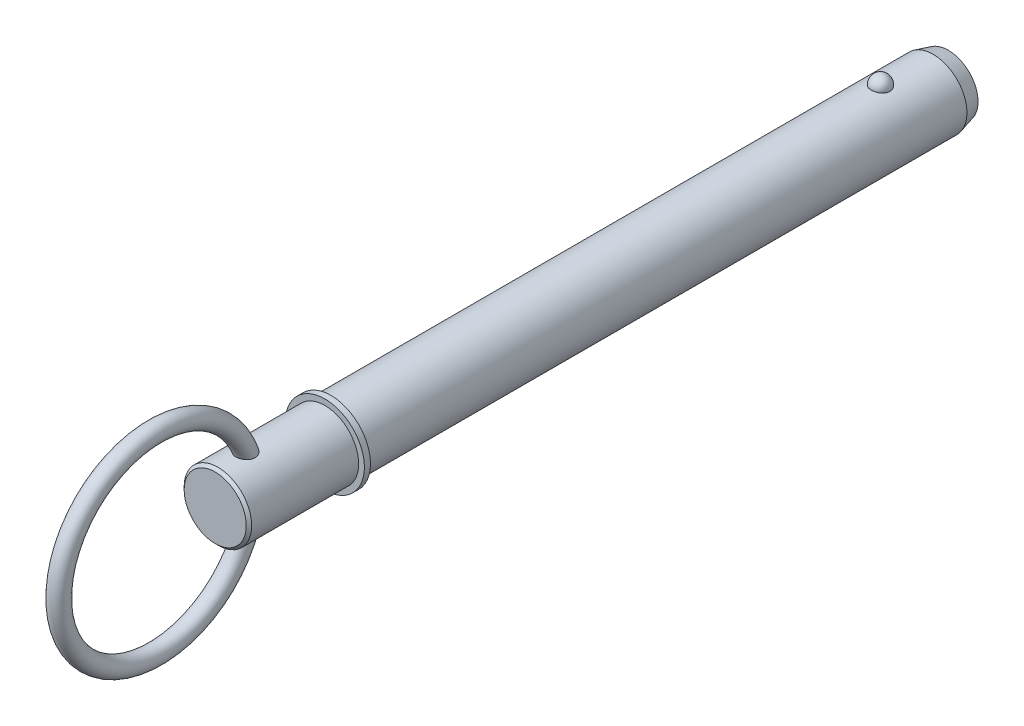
ISO-10303-21;
HEADER;
FILE_DESCRIPTION(('STEP AP214'),'2;1');
FILE_NAME('part.step','',(''),(''),'','','');
FILE_SCHEMA(('AUTOMOTIVE_DESIGN { 1 0 10303 214 1 1 1 1 }'));
ENDSEC;
DATA;
#1=APPLICATION_CONTEXT('core data for automotive mechanical design processes');
#2=APPLICATION_PROTOCOL_DEFINITION('international standard','automotive_design',2000,#1);
#3=PRODUCT_CONTEXT('',#1,'mechanical');
#4=PRODUCT('Part','Part','',(#3));
#5=PRODUCT_RELATED_PRODUCT_CATEGORY('part','',(#4));
#6=PRODUCT_DEFINITION_FORMATION('','',#4);
#7=PRODUCT_DEFINITION_CONTEXT('part definition',#1,'design');
#8=PRODUCT_DEFINITION('design','',#6,#7);
#9=PRODUCT_DEFINITION_SHAPE('','',#8);
#10=(LENGTH_UNIT() NAMED_UNIT(*) SI_UNIT(.MILLI.,.METRE.));
#11=(NAMED_UNIT(*) PLANE_ANGLE_UNIT() SI_UNIT($,.RADIAN.));
#12=(NAMED_UNIT(*) SI_UNIT($,.STERADIAN.) SOLID_ANGLE_UNIT());
#13=UNCERTAINTY_MEASURE_WITH_UNIT(LENGTH_MEASURE(1.E-05),#10,'distance_accuracy_value','');
#14=(GEOMETRIC_REPRESENTATION_CONTEXT(3) GLOBAL_UNCERTAINTY_ASSIGNED_CONTEXT((#13)) GLOBAL_UNIT_ASSIGNED_CONTEXT((#10,
#11,#12)) REPRESENTATION_CONTEXT('',''));
#15=CARTESIAN_POINT('',(0.,0.,0.));
#16=DIRECTION('',(0.,0.,1.));
#17=DIRECTION('',(1.,0.,0.));
#18=AXIS2_PLACEMENT_3D('',#15,#16,#17);
#19=CARTESIAN_POINT('',(0.,0.,177.8));
#20=DIRECTION('',(0.,0.,-1.));
#21=DIRECTION('',(-1.,0.,0.));
#22=AXIS2_PLACEMENT_3D('',#19,#20,#21);
#23=CYLINDRICAL_SURFACE('',#22,11.115);
#24=CARTESIAN_POINT('',(3.04058343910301,10.6910278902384,-3.06999999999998));
#25=CARTESIAN_POINT('',(3.04058039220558,10.6910304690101,-2.89837124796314));
#26=CARTESIAN_POINT('',(3.02657193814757,10.6950430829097,-2.72670368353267));
#27=CARTESIAN_POINT('',(2.97087341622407,10.7106465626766,-2.38822964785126));
#28=CARTESIAN_POINT('',(2.92917240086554,10.7222404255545,-2.22142512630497));
#29=CARTESIAN_POINT('',(2.81915317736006,10.751689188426,-1.89750816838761));
#30=CARTESIAN_POINT('',(2.75084669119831,10.7695413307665,-1.74039149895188));
#31=CARTESIAN_POINT('',(2.58932284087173,10.809510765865,-1.4401395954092));
#32=CARTESIAN_POINT('',(2.49610617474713,10.8316279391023,-1.29700396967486));
#33=CARTESIAN_POINT('',(2.28659317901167,10.877786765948,-1.02797591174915));
#34=CARTESIAN_POINT('',(2.17018825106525,10.9018371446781,-0.902169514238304));
#35=CARTESIAN_POINT('',(1.91759004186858,10.9490888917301,-0.672091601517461));
#36=CARTESIAN_POINT('',(1.78139672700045,10.9722902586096,-0.567820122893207));
#37=CARTESIAN_POINT('',(1.49327884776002,11.0151925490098,-0.38399276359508));
#38=CARTESIAN_POINT('',(1.34139928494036,11.034903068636,-0.304368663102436));
#39=CARTESIAN_POINT('',(1.02584823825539,11.0686948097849,-0.171731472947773));
#40=CARTESIAN_POINT('',(0.86217801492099,11.0827766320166,-0.118715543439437));
#41=CARTESIAN_POINT('',(0.530748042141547,11.1035404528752,-0.041530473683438));
#42=CARTESIAN_POINT('',(0.363109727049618,11.1103474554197,-0.0168734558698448));
#43=CARTESIAN_POINT('',(0.0259327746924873,11.1162480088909,0.00453486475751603));
#44=CARTESIAN_POINT('',(-0.143605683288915,11.1153422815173,0.00128877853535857));
#45=CARTESIAN_POINT('',(-0.477280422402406,11.1059854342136,-0.0327676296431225));
#46=CARTESIAN_POINT('',(-0.641459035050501,11.0976393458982,-0.0631942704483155));
#47=CARTESIAN_POINT('',(-0.962236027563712,11.0744390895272,-0.150220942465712));
#48=CARTESIAN_POINT('',(-1.11883427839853,11.0595848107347,-0.206821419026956));
#49=CARTESIAN_POINT('',(-1.4210461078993,11.0248420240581,-0.345028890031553));
#50=CARTESIAN_POINT('',(-1.56659244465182,11.0049254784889,-0.426775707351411));
#51=CARTESIAN_POINT('',(-1.84189316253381,10.9622119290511,-0.612956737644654));
#52=CARTESIAN_POINT('',(-1.97164597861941,10.9394146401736,-0.717393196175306));
#53=CARTESIAN_POINT('',(-2.21432263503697,10.8929139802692,-0.948332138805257));
#54=CARTESIAN_POINT('',(-2.3268890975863,10.8692016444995,-1.07520847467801));
#55=CARTESIAN_POINT('',(-2.52940007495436,10.8238699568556,-1.34622145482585));
#56=CARTESIAN_POINT('',(-2.6193430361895,10.8022507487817,-1.49035928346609));
#57=CARTESIAN_POINT('',(-2.77523958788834,10.7632629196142,-1.79367507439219));
#58=CARTESIAN_POINT('',(-2.8409151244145,10.7459442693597,-1.95300253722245));
#59=CARTESIAN_POINT('',(-2.94519180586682,10.7178360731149,-2.28083009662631));
#60=CARTESIAN_POINT('',(-2.98379371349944,10.707046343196,-2.44932993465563));
#61=CARTESIAN_POINT('',(-3.03284665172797,10.6932559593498,-2.78998091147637));
#62=CARTESIAN_POINT('',(-3.04341313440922,10.6902233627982,-2.96211412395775));
#63=CARTESIAN_POINT('',(-3.03646037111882,10.6922002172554,-3.30576225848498));
#64=CARTESIAN_POINT('',(-3.0189418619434,10.6972094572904,-3.47727719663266));
#65=CARTESIAN_POINT('',(-2.95641582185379,10.7146564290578,-3.81396465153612));
#66=CARTESIAN_POINT('',(-2.91154117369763,10.7270582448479,-3.97916375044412));
#67=CARTESIAN_POINT('',(-2.79553341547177,10.7578713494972,-4.29947360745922));
#68=CARTESIAN_POINT('',(-2.72439927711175,10.7762828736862,-4.45458397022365));
#69=CARTESIAN_POINT('',(-2.55718900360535,10.8171819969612,-4.75123550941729));
#70=CARTESIAN_POINT('',(-2.46098224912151,10.8396907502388,-4.89270014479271));
#71=CARTESIAN_POINT('',(-2.24623042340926,10.8862165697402,-5.15724095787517));
#72=CARTESIAN_POINT('',(-2.12768452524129,10.9102336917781,-5.28031645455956));
#73=CARTESIAN_POINT('',(-1.87085107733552,10.9571990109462,-5.50509615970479));
#74=CARTESIAN_POINT('',(-1.73249451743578,10.9801430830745,-5.6067224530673));
#75=CARTESIAN_POINT('',(-1.44010079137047,11.0223008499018,-5.78517789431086));
#76=CARTESIAN_POINT('',(-1.28606470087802,11.0415148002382,-5.86200874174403));
#77=CARTESIAN_POINT('',(-0.968615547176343,11.0738491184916,-5.98788441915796));
#78=CARTESIAN_POINT('',(-0.805339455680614,11.0870408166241,-6.0372561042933));
#79=CARTESIAN_POINT('',(-0.47244987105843,11.1062048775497,-6.10820004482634));
#80=CARTESIAN_POINT('',(-0.302837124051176,11.11217808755,-6.12977556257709));
#81=CARTESIAN_POINT('',(0.0345765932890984,11.1162034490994,-6.14436196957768));
#82=CARTESIAN_POINT('',(0.20235372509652,11.1143988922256,-6.13788957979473));
#83=CARTESIAN_POINT('',(0.534364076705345,11.103390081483,-6.0977398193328));
#84=CARTESIAN_POINT('',(0.698597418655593,11.094186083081,-6.06406338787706));
#85=CARTESIAN_POINT('',(1.01830314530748,11.0694136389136,-5.97063285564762));
#86=CARTESIAN_POINT('',(1.17380497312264,11.0538682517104,-5.91097318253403));
#87=CARTESIAN_POINT('',(1.472484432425,11.0180608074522,-5.76723645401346));
#88=CARTESIAN_POINT('',(1.6156613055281,10.9977984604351,-5.68315789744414));
#89=CARTESIAN_POINT('',(1.88801614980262,10.9543574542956,-5.49138807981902));
#90=CARTESIAN_POINT('',(2.01695079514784,10.9311394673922,-5.38336024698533));
#91=CARTESIAN_POINT('',(2.25501495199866,10.8845248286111,-5.14733839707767));
#92=CARTESIAN_POINT('',(2.36414099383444,10.8611281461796,-5.01934088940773));
#93=CARTESIAN_POINT('',(2.56152595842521,10.8162958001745,-4.7444793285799));
#94=CARTESIAN_POINT('',(2.64940088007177,10.7948999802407,-4.59733288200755));
#95=CARTESIAN_POINT('',(2.79961494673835,10.7569242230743,-4.29001203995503));
#96=CARTESIAN_POINT('',(2.86196390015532,10.7403424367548,-4.12984267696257));
#97=CARTESIAN_POINT('',(2.95377333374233,10.715429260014,-3.82062342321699));
#98=CARTESIAN_POINT('',(2.98627018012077,10.7063495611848,-3.67252681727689));
#99=CARTESIAN_POINT('',(3.02967634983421,10.6941478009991,-3.37296350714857));
#100=CARTESIAN_POINT('',(3.04058612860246,10.6910256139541,-3.22149687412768));
#101=CARTESIAN_POINT('',(3.04058343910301,10.6910278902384,-3.06999999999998));
#102=B_SPLINE_CURVE_WITH_KNOTS('',3,(#24,#25,#26,#27,#28,#29,#30,#31,#32,#33,#34,#35,#36,#37,
#38,#39,#40,#41,#42,#43,#44,#45,#46,#47,#48,#49,#50,#51,#52,#53,#54,#55,#56,#57,#58,#59,#60,#61,
#62,#63,#64,#65,#66,#67,#68,#69,#70,#71,#72,#73,#74,#75,#76,#77,#78,#79,#80,#81,#82,#83,#84,#85,
#86,#87,#88,#89,#90,#91,#92,#93,#94,#95,#96,#97,#98,#99,#100,#101),.UNSPECIFIED.,.T.,.F.,(4,2,2,
2,2,2,2,2,2,2,2,2,2,2,2,2,2,2,2,2,2,2,2,2,2,2,2,2,2,2,2,2,2,2,2,2,2,2,4),(0.,0.514341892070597,
1.02888723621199,1.54320613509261,2.0575106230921,2.57428293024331,3.09105611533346,
3.60638589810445,4.1216606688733,4.62793159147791,5.1341551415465,5.63334381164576,
6.13254097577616,6.63456562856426,7.13663998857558,7.64804063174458,8.15947638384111,
8.6766026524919,9.19371435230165,9.70869321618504,10.223658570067,10.7361421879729,
11.2486458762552,11.7638748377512,12.2791228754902,12.7962115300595,13.3132647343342,
13.8240238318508,14.3347229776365,14.8360540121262,15.3373677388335,15.8368746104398,
16.3364121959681,16.8434736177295,17.3506237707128,17.8663484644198,18.3818748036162,
18.8358944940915,19.2899046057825),.UNSPECIFIED.);
#103=CARTESIAN_POINT('',(3.04058343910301,10.6910278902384,-3.06999999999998));
#104=VERTEX_POINT('',#103);
#105=EDGE_CURVE('E102',#104,#104,#102,.T.);
#106=ORIENTED_EDGE('',*,*,#105,.T.);
#107=EDGE_LOOP('',(#106));
#108=FACE_BOUND('',#107,.T.);
#109=CARTESIAN_POINT('',(0.,0.,-20.3999999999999));
#110=DIRECTION('',(0.,0.,-1.));
#111=DIRECTION('',(-1.,0.,0.));
#112=AXIS2_PLACEMENT_3D('',#109,#110,#111);
#113=CIRCLE('',#112,11.115);
#114=CARTESIAN_POINT('',(-11.115,0.,-20.3999999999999));
#115=VERTEX_POINT('',#114);
#116=EDGE_CURVE('E110',#115,#115,#113,.F.);
#117=ORIENTED_EDGE('',*,*,#116,.T.);
#118=EDGE_LOOP('',(#117));
#119=FACE_BOUND('',#118,.T.);
#120=CARTESIAN_POINT('',(0.,0.,177.8));
#121=DIRECTION('',(0.,0.,1.));
#122=DIRECTION('',(1.,0.,0.));
#123=AXIS2_PLACEMENT_3D('',#120,#121,#122);
#124=CIRCLE('',#123,11.115);
#125=CARTESIAN_POINT('',(11.115,0.,177.8));
#126=VERTEX_POINT('',#125);
#127=EDGE_CURVE('E108',#126,#126,#124,.T.);
#128=ORIENTED_EDGE('',*,*,#127,.F.);
#129=EDGE_LOOP('',(#128));
#130=FACE_BOUND('',#129,.T.);
#131=ADVANCED_FACE('F39',(#108,#119,#130),#23,.T.);
#132=CARTESIAN_POINT('',(0.,0.,-25.4));
#133=DIRECTION('',(0.,0.,-1.));
#134=DIRECTION('',(-1.,0.,0.));
#135=AXIS2_PLACEMENT_3D('',#132,#133,#134);
#136=PLANE('',#135);
#137=CARTESIAN_POINT('',(0.,0.,-25.4));
#138=DIRECTION('',(0.,0.,-1.));
#139=DIRECTION('',(-1.,0.,0.));
#140=AXIS2_PLACEMENT_3D('',#137,#138,#139);
#141=CIRCLE('',#140,9.77525403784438);
#142=CARTESIAN_POINT('',(-9.77525403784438,0.,-25.4));
#143=VERTEX_POINT('',#142);
#144=EDGE_CURVE('E142',#143,#143,#141,.T.);
#145=ORIENTED_EDGE('',*,*,#144,.T.);
#146=EDGE_LOOP('',(#145));
#147=FACE_BOUND('',#146,.T.);
#148=ADVANCED_FACE('F88',(#147),#136,.T.);
#149=CARTESIAN_POINT('',(0.,0.,-25.4));
#150=DIRECTION('',(0.,0.,1.));
#151=DIRECTION('',(1.,0.,0.));
#152=AXIS2_PLACEMENT_3D('',#149,#150,#151);
#153=CONICAL_SURFACE('',#152,9.77525403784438,0.261799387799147);
#154=ORIENTED_EDGE('',*,*,#116,.F.);
#155=EDGE_LOOP('',(#154));
#156=FACE_BOUND('',#155,.T.);
#157=ORIENTED_EDGE('',*,*,#144,.F.);
#158=EDGE_LOOP('',(#157));
#159=FACE_BOUND('',#158,.T.);
#160=ADVANCED_FACE('F94',(#156,#159),#153,.T.);
#161=CARTESIAN_POINT('',(0.,11.115,-3.06999999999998));
#162=DIRECTION('',(0.,1.,0.));
#163=DIRECTION('',(0.,0.,1.));
#164=AXIS2_PLACEMENT_3D('',#161,#162,#163);
#165=SPHERICAL_SURFACE('',#164,3.07);
#166=ORIENTED_EDGE('',*,*,#105,.F.);
#167=EDGE_LOOP('',(#166));
#168=FACE_BOUND('',#167,.T.);
#169=ADVANCED_FACE('F113',(#168),#165,.T.);
#170=CARTESIAN_POINT('',(0.,0.,177.8));
#171=DIRECTION('',(0.,0.,-1.));
#172=DIRECTION('',(-1.,0.,0.));
#173=AXIS2_PLACEMENT_3D('',#170,#171,#172);
#174=PLANE('',#173);
#175=ORIENTED_EDGE('',*,*,#127,.T.);
#176=EDGE_LOOP('',(#175));
#177=FACE_BOUND('',#176,.T.);
#178=CARTESIAN_POINT('',(0.,0.,177.8));
#179=DIRECTION('',(0.,0.,-1.));
#180=DIRECTION('',(-1.,0.,0.));
#181=AXIS2_PLACEMENT_3D('',#178,#179,#180);
#182=CIRCLE('',#181,13.);
#183=CARTESIAN_POINT('',(-13.,0.,177.8));
#184=VERTEX_POINT('',#183);
#185=EDGE_CURVE('E109',#184,#184,#182,.T.);
#186=ORIENTED_EDGE('',*,*,#185,.T.);
#187=EDGE_LOOP('',(#186));
#188=FACE_BOUND('',#187,.T.);
#189=ADVANCED_FACE('F117',(#177,#188),#174,.T.);
#190=CARTESIAN_POINT('',(0.,0.,33.7287874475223));
#191=DIRECTION('',(0.,0.,-1.));
#192=DIRECTION('',(-1.,0.,0.));
#193=AXIS2_PLACEMENT_3D('',#190,#191,#192);
#194=CYLINDRICAL_SURFACE('',#193,13.);
#195=CARTESIAN_POINT('',(0.,0.,179.8));
#196=DIRECTION('',(0.,0.,-1.));
#197=DIRECTION('',(-1.,0.,0.));
#198=AXIS2_PLACEMENT_3D('',#195,#196,#197);
#199=CIRCLE('',#198,13.);
#200=CARTESIAN_POINT('',(-13.,0.,179.8));
#201=VERTEX_POINT('',#200);
#202=EDGE_CURVE('E134',#201,#201,#199,.T.);
#203=ORIENTED_EDGE('',*,*,#202,.T.);
#204=EDGE_LOOP('',(#203));
#205=FACE_BOUND('',#204,.T.);
#206=ORIENTED_EDGE('',*,*,#185,.F.);
#207=EDGE_LOOP('',(#206));
#208=FACE_BOUND('',#207,.T.);
#209=ADVANCED_FACE('F121',(#205,#208),#194,.T.);
#210=CARTESIAN_POINT('',(0.,13.,179.8));
#211=DIRECTION('',(0.,0.,1.));
#212=DIRECTION('',(1.,0.,0.));
#213=AXIS2_PLACEMENT_3D('',#210,#211,#212);
#214=PLANE('',#213);
#215=CARTESIAN_POINT('',(0.,0.,179.8));
#216=DIRECTION('',(0.,0.,1.));
#217=DIRECTION('',(1.,0.,0.));
#218=AXIS2_PLACEMENT_3D('',#215,#216,#217);
#219=CIRCLE('',#218,11.115);
#220=CARTESIAN_POINT('',(11.115,0.,179.8));
#221=VERTEX_POINT('',#220);
#222=EDGE_CURVE('E112',#221,#221,#219,.T.);
#223=ORIENTED_EDGE('',*,*,#222,.F.);
#224=EDGE_LOOP('',(#223));
#225=FACE_BOUND('',#224,.T.);
#226=ORIENTED_EDGE('',*,*,#202,.F.);
#227=EDGE_LOOP('',(#226));
#228=FACE_BOUND('',#227,.T.);
#229=ADVANCED_FACE('F85',(#225,#228),#214,.T.);
#230=CARTESIAN_POINT('',(0.,0.,215.9));
#231=DIRECTION('',(0.,0.,-1.));
#232=DIRECTION('',(-1.,0.,0.));
#233=AXIS2_PLACEMENT_3D('',#230,#231,#232);
#234=CYLINDRICAL_SURFACE('',#233,11.115);
#235=CARTESIAN_POINT('',(-1.22435852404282,-11.0473603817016,202.978419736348));
#236=CARTESIAN_POINT('',(-1.0707801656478,-11.0643805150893,202.911699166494));
#237=CARTESIAN_POINT('',(-0.911372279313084,-11.0787777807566,202.857745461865));
#238=CARTESIAN_POINT('',(-0.585451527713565,-11.1007717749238,202.776552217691));
#239=CARTESIAN_POINT('',(-0.418938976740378,-11.1083688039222,202.749311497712));
#240=CARTESIAN_POINT('',(-0.0835394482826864,-11.1159515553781,202.722121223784));
#241=CARTESIAN_POINT('',(0.0853474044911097,-11.1159376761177,202.722170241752));
#242=CARTESIAN_POINT('',(0.420723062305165,-11.1083011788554,202.749554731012));
#243=CARTESIAN_POINT('',(0.58721183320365,-11.1006784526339,202.776890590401));
#244=CARTESIAN_POINT('',(0.913189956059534,-11.0786293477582,202.85829957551));
#245=CARTESIAN_POINT('',(1.07267378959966,-11.0641977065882,202.912393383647));
#246=CARTESIAN_POINT('',(1.3799404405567,-11.0300907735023,203.046140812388));
#247=CARTESIAN_POINT('',(1.52772335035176,-11.0104155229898,203.125794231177));
#248=CARTESIAN_POINT('',(1.80679367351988,-10.9680716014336,203.308467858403));
#249=CARTESIAN_POINT('',(1.93814041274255,-10.945414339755,203.411400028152));
#250=CARTESIAN_POINT('',(2.18117403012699,-10.8995884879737,203.638212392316));
#251=CARTESIAN_POINT('',(2.29286356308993,-10.8764199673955,203.762089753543));
#252=CARTESIAN_POINT('',(2.49238969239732,-10.8324319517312,204.025992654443));
#253=CARTESIAN_POINT('',(2.58046870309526,-10.8115899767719,204.165831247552));
#254=CARTESIAN_POINT('',(2.73218762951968,-10.7742522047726,204.458691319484));
#255=CARTESIAN_POINT('',(2.7958294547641,-10.757756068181,204.611711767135));
#256=CARTESIAN_POINT('',(2.89767977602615,-10.7307723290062,204.9266092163));
#257=CARTESIAN_POINT('',(2.93586554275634,-10.7202900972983,205.088493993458));
#258=CARTESIAN_POINT('',(2.98678800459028,-10.7062139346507,205.416480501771));
#259=CARTESIAN_POINT('',(2.99951894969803,-10.7026215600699,205.582583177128));
#260=CARTESIAN_POINT('',(3.0004780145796,-10.7023530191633,205.923227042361));
#261=CARTESIAN_POINT('',(2.98743421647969,-10.7060358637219,206.097770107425));
#262=CARTESIAN_POINT('',(2.93592917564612,-10.7202719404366,206.442750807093));
#263=CARTESIAN_POINT('',(2.8974582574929,-10.7308277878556,206.613186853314));
#264=CARTESIAN_POINT('',(2.79180512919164,-10.7588257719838,206.963114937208));
#265=CARTESIAN_POINT('',(2.72213928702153,-10.776850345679,207.141811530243));
#266=CARTESIAN_POINT('',(2.55612841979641,-10.8174264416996,207.485974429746));
#267=CARTESIAN_POINT('',(2.4597569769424,-10.8399824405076,207.651427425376));
#268=CARTESIAN_POINT('',(2.23434632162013,-10.8887625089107,207.975672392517));
#269=CARTESIAN_POINT('',(2.10349593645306,-10.9151327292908,208.133192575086));
#270=CARTESIAN_POINT('',(1.81505097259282,-10.96677510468,208.421668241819));
#271=CARTESIAN_POINT('',(1.65749731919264,-10.9920488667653,208.55266371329));
#272=CARTESIAN_POINT('',(1.36197799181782,-11.0319737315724,208.751313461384));
#273=CARTESIAN_POINT('',(1.22927684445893,-11.0476896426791,208.82660092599));
#274=CARTESIAN_POINT('',(0.952979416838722,-11.0749380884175,208.954574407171));
#275=CARTESIAN_POINT('',(0.809393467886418,-11.0864745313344,209.007281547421));
#276=CARTESIAN_POINT('',(0.513954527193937,-11.1041011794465,209.087058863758));
#277=CARTESIAN_POINT('',(0.362058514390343,-11.1101594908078,209.113978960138));
#278=CARTESIAN_POINT('',(0.0557792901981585,-11.1159132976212,209.139559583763));
#279=CARTESIAN_POINT('',(-0.0986030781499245,-11.1156109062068,209.138229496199));
#280=CARTESIAN_POINT('',(-0.389768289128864,-11.1090283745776,209.108935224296));
#281=CARTESIAN_POINT('',(-0.526830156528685,-11.1033186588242,209.083512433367));
#282=CARTESIAN_POINT('',(-0.794878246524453,-11.0873547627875,209.011270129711));
#283=CARTESIAN_POINT('',(-0.925863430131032,-11.0770998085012,208.964446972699));
#284=CARTESIAN_POINT('',(-1.18354406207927,-11.0525934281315,208.849843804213));
#285=CARTESIAN_POINT('',(-1.30991621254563,-11.0382116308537,208.781371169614));
#286=CARTESIAN_POINT('',(-1.55122352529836,-11.0068962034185,208.627131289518));
#287=CARTESIAN_POINT('',(-1.66615377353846,-10.9899614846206,208.541356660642));
#288=CARTESIAN_POINT('',(-1.90024050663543,-10.9520991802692,208.34087205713));
#289=CARTESIAN_POINT('',(-2.01728342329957,-10.9309598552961,208.223737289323));
#290=CARTESIAN_POINT('',(-2.23333659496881,-10.8888735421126,207.973839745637));
#291=CARTESIAN_POINT('',(-2.33233396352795,-10.8679267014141,207.841065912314));
#292=CARTESIAN_POINT('',(-2.52607041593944,-10.8246766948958,207.540000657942));
#293=CARTESIAN_POINT('',(-2.61741570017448,-10.8027194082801,207.369462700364));
#294=CARTESIAN_POINT('',(-2.77251687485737,-10.7639568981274,207.015671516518));
#295=CARTESIAN_POINT('',(-2.83625783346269,-10.7471544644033,206.832411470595));
#296=CARTESIAN_POINT('',(-2.93668505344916,-10.7201706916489,206.446624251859));
#297=CARTESIAN_POINT('',(-2.97161961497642,-10.7104219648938,206.243594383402));
#298=CARTESIAN_POINT('',(-2.99683495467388,-10.7033740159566,205.936874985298));
#299=CARTESIAN_POINT('',(-3.00070536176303,-10.7022882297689,205.834234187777));
#300=CARTESIAN_POINT('',(-2.99908594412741,-10.7027439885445,205.629049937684));
#301=CARTESIAN_POINT('',(-2.99360154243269,-10.7042840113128,205.526506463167));
#302=CARTESIAN_POINT('',(-2.97382504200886,-10.7097936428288,205.330330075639));
#303=CARTESIAN_POINT('',(-2.9602439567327,-10.7135669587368,205.236619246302));
#304=CARTESIAN_POINT('',(-2.92480741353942,-10.723295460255,205.050932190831));
#305=CARTESIAN_POINT('',(-2.90295619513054,-10.7292495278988,204.95895510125));
#306=CARTESIAN_POINT('',(-2.85097003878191,-10.7431800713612,204.777547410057));
#307=CARTESIAN_POINT('',(-2.82083748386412,-10.7511559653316,204.688116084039));
#308=CARTESIAN_POINT('',(-2.75241691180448,-10.7688750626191,204.51264532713));
#309=CARTESIAN_POINT('',(-2.71412954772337,-10.7786181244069,204.42660562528));
#310=CARTESIAN_POINT('',(-2.59550576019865,-10.807996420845,204.191055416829));
#311=CARTESIAN_POINT('',(-2.50612224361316,-10.8292837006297,204.046173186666));
#312=CARTESIAN_POINT('',(-2.30366035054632,-10.8741467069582,203.774571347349));
#313=CARTESIAN_POINT('',(-2.19058370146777,-10.8977222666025,203.647850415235));
#314=CARTESIAN_POINT('',(-1.94442412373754,-10.9443154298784,203.416462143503));
#315=CARTESIAN_POINT('',(-1.81141354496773,-10.967334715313,203.31171820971));
#316=CARTESIAN_POINT('',(-1.52904284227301,-11.0102504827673,203.126435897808));
#317=CARTESIAN_POINT('',(-1.37968206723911,-11.0301468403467,203.045898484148));
#318=CARTESIAN_POINT('',(-1.22435852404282,-11.0473603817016,202.978419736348));
#319=B_SPLINE_CURVE_WITH_KNOTS('',3,(#235,#236,#237,#238,#239,#240,#241,#242,#243,#244,#245,
#246,#247,#248,#249,#250,#251,#252,#253,#254,#255,#256,#257,#258,#259,#260,#261,#262,#263,#264,
#265,#266,#267,#268,#269,#270,#271,#272,#273,#274,#275,#276,#277,#278,#279,#280,#281,#282,#283,
#284,#285,#286,#287,#288,#289,#290,#291,#292,#293,#294,#295,#296,#297,#298,#299,#300,#301,#302,
#303,#304,#305,#306,#307,#308,#309,#310,#311,#312,#313,#314,#315,#316,#317,#318),.UNSPECIFIED.,
.T.,.F.,(4,2,2,2,2,2,2,2,2,2,2,2,2,2,2,2,2,2,2,2,2,2,2,2,2,2,2,2,2,2,2,2,2,2,2,2,2,2,2,2,2,4),
(0.,0.504317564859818,1.00861284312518,1.51288173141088,2.01715779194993,2.52182424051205,
3.02648670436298,3.52927157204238,4.03198848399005,4.52932690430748,5.02662645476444,
5.5243694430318,6.02222485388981,6.54526169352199,7.06849767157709,7.64398785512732,
8.22004937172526,8.83633461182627,9.45168373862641,9.90997173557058,10.3678300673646,
10.8283372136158,11.2886913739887,11.7053264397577,12.1220324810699,12.5537129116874,
12.9855779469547,13.4844842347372,13.9837454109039,14.5653303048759,15.1472294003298,
15.762338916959,16.0701226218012,16.3777279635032,16.6616380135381,16.9454027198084,
17.229085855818,17.5127462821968,18.0246262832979,18.5364689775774,19.0464970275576,
19.5565453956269),.UNSPECIFIED.);
#320=CARTESIAN_POINT('',(-1.22435852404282,-11.0473603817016,202.978419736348));
#321=VERTEX_POINT('',#320);
#322=EDGE_CURVE('E10',#321,#321,#319,.T.);
#323=ORIENTED_EDGE('',*,*,#322,.F.);
#324=EDGE_LOOP('',(#323));
#325=FACE_BOUND('',#324,.T.);
#326=CARTESIAN_POINT('',(-1.22435852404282,11.0473603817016,202.978419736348));
#327=CARTESIAN_POINT('',(-1.3763077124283,11.0305212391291,203.044431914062));
#328=CARTESIAN_POINT('',(-1.52254325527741,11.0111158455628,203.122938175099));
#329=CARTESIAN_POINT('',(-1.79945383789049,10.9692671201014,203.30315338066));
#330=CARTESIAN_POINT('',(-1.9301301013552,10.9468240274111,203.404860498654));
#331=CARTESIAN_POINT('',(-2.17227655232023,10.9013603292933,203.629035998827));
#332=CARTESIAN_POINT('',(-2.28373752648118,10.8783394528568,203.751514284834));
#333=CARTESIAN_POINT('',(-2.48427458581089,10.8343057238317,204.013895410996));
#334=CARTESIAN_POINT('',(-2.57335330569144,10.8132926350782,204.153796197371));
#335=CARTESIAN_POINT('',(-2.72640074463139,10.7757209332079,204.445964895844));
#336=CARTESIAN_POINT('',(-2.79054231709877,10.7591319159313,204.59813851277));
#337=CARTESIAN_POINT('',(-2.89354234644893,10.7318913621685,204.911286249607));
#338=CARTESIAN_POINT('',(-2.932399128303,10.7212402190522,205.072260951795));
#339=CARTESIAN_POINT('',(-2.98540436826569,10.7066038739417,205.401955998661));
#340=CARTESIAN_POINT('',(-2.99901659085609,10.7027634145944,205.570768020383));
#341=CARTESIAN_POINT('',(-3.0008814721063,10.7022388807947,205.908508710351));
#342=CARTESIAN_POINT('',(-2.98912652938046,10.7055569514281,206.077437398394));
#343=CARTESIAN_POINT('',(-2.93985175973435,10.7191979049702,206.424856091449));
#344=CARTESIAN_POINT('',(-2.90036626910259,10.7300544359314,206.603044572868));
#345=CARTESIAN_POINT('',(-2.7955500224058,10.7578360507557,206.951215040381));
#346=CARTESIAN_POINT('',(-2.73019988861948,10.774765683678,207.121190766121));
#347=CARTESIAN_POINT('',(-2.56762574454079,10.8147227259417,207.465784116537));
#348=CARTESIAN_POINT('',(-2.46786230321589,10.838191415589,207.639157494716));
#349=CARTESIAN_POINT('',(-2.24100420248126,10.8873575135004,207.966686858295));
#350=CARTESIAN_POINT('',(-2.11391925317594,10.9130541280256,208.120849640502));
#351=CARTESIAN_POINT('',(-1.85542700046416,10.9597063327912,208.382735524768));
#352=CARTESIAN_POINT('',(-1.72758345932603,10.9807909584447,208.493955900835));
#353=CARTESIAN_POINT('',(-1.45489931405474,11.0202250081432,208.69412236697));
#354=CARTESIAN_POINT('',(-1.31006770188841,11.0385758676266,208.783080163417));
#355=CARTESIAN_POINT('',(-1.08171164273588,11.0625084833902,208.8963702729));
#356=CARTESIAN_POINT('',(-1.00332234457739,11.069914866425,208.930896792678));
#357=CARTESIAN_POINT('',(-0.843525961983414,11.0832350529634,208.992391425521));
#358=CARTESIAN_POINT('',(-0.76212057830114,11.0891496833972,209.019363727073));
#359=CARTESIAN_POINT('',(-0.597014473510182,11.0992628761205,209.06518193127));
#360=CARTESIAN_POINT('',(-0.513315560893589,11.1034627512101,209.084034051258));
#361=CARTESIAN_POINT('',(-0.34437442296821,11.1099851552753,209.113209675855));
#362=CARTESIAN_POINT('',(-0.259132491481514,11.1123080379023,209.123534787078));
#363=CARTESIAN_POINT('',(-0.100838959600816,11.114780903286,209.134519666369));
#364=CARTESIAN_POINT('',(-0.0278735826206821,11.1152042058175,209.136395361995));
#365=CARTESIAN_POINT('',(0.117962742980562,11.1146132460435,209.133773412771));
#366=CARTESIAN_POINT('',(0.190833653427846,11.1135985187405,209.129273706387));
#367=CARTESIAN_POINT('',(0.335842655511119,11.110161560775,209.113978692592));
#368=CARTESIAN_POINT('',(0.407981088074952,11.1077400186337,209.103186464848));
#369=CARTESIAN_POINT('',(0.551029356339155,11.1015643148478,209.075503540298));
#370=CARTESIAN_POINT('',(0.621938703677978,11.0978096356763,209.058610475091));
#371=CARTESIAN_POINT('',(0.82538178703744,11.0851145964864,209.001054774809));
#372=CARTESIAN_POINT('',(0.955713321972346,11.0745538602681,208.952705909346));
#373=CARTESIAN_POINT('',(1.20733127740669,11.0499605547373,208.837325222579));
#374=CARTESIAN_POINT('',(1.32861527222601,11.0359270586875,208.770288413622));
#375=CARTESIAN_POINT('',(1.57344360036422,11.0038352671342,208.611843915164));
#376=CARTESIAN_POINT('',(1.69572941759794,10.9855025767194,208.518551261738));
#377=CARTESIAN_POINT('',(1.92565215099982,10.9475431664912,208.315650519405));
#378=CARTESIAN_POINT('',(2.0332801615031,10.9279156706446,208.206032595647));
#379=CARTESIAN_POINT('',(2.25048911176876,10.8854412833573,207.95299112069));
#380=CARTESIAN_POINT('',(2.35710396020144,10.8626332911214,207.807010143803));
#381=CARTESIAN_POINT('',(2.5475731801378,10.8195493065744,207.500478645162));
#382=CARTESIAN_POINT('',(2.63141052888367,10.799275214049,207.339917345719));
#383=CARTESIAN_POINT('',(2.78342312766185,10.7611645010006,206.987827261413));
#384=CARTESIAN_POINT('',(2.84851472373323,10.7439117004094,206.794893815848));
#385=CARTESIAN_POINT('',(2.9456265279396,10.7177011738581,206.400130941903));
#386=CARTESIAN_POINT('',(2.97764942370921,10.7087427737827,206.19830223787));
#387=CARTESIAN_POINT('',(2.99864828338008,10.7028651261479,205.895989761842));
#388=CARTESIAN_POINT('',(3.00125529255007,10.7021342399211,205.796378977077));
#389=CARTESIAN_POINT('',(2.9976304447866,10.7031517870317,205.597345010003));
#390=CARTESIAN_POINT('',(2.99140295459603,10.704898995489,205.497921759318));
#391=CARTESIAN_POINT('',(2.96990080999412,10.710883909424,205.300179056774));
#392=CARTESIAN_POINT('',(2.95463019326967,10.7151205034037,205.201859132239));
#393=CARTESIAN_POINT('',(2.91493260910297,10.7259879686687,205.007219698));
#394=CARTESIAN_POINT('',(2.89050674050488,10.7326185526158,204.910899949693));
#395=CARTESIAN_POINT('',(2.83556656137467,10.7472556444,204.731222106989));
#396=CARTESIAN_POINT('',(2.80596337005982,10.7550439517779,204.647566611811));
#397=CARTESIAN_POINT('',(2.73953102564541,10.7721572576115,204.483300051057));
#398=CARTESIAN_POINT('',(2.7026993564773,10.7814827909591,204.402690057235));
#399=CARTESIAN_POINT('',(2.6220344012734,10.801383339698,204.245273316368));
#400=CARTESIAN_POINT('',(2.57820565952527,10.8119575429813,204.168464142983));
#401=CARTESIAN_POINT('',(2.48382482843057,10.8340293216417,204.019223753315));
#402=CARTESIAN_POINT('',(2.4332703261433,10.8455272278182,203.946794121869));
#403=CARTESIAN_POINT('',(2.27895739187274,10.879345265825,203.745992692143));
#404=CARTESIAN_POINT('',(2.16717186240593,10.9023791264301,203.623764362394));
#405=CARTESIAN_POINT('',(1.92442677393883,10.9478318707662,203.400151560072));
#406=CARTESIAN_POINT('',(1.79346836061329,10.9702507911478,203.298765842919));
#407=CARTESIAN_POINT('',(1.51657151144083,11.0119360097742,203.119564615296));
#408=CARTESIAN_POINT('',(1.37069187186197,11.0312139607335,203.041661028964));
#409=CARTESIAN_POINT('',(1.0676440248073,11.0646548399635,202.910680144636));
#410=CARTESIAN_POINT('',(0.910475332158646,11.0788175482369,202.857603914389));
#411=CARTESIAN_POINT('',(0.587492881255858,11.1006548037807,202.77697871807));
#412=CARTESIAN_POINT('',(0.421604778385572,11.1082585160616,202.749708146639));
#413=CARTESIAN_POINT('',(0.0874262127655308,11.1159127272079,202.722259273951));
#414=CARTESIAN_POINT('',(-0.080864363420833,11.1159628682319,202.72208225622));
#415=CARTESIAN_POINT('',(-0.416252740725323,11.1084780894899,202.748918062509));
#416=CARTESIAN_POINT('',(-0.583334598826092,11.1008914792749,202.776116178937));
#417=CARTESIAN_POINT('',(-0.910355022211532,11.0788693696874,202.857401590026));
#418=CARTESIAN_POINT('',(-1.07029370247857,11.064433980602,202.911488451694));
#419=CARTESIAN_POINT('',(-1.22435852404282,11.0473603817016,202.978419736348));
#420=B_SPLINE_CURVE_WITH_KNOTS('',3,(#326,#327,#328,#329,#330,#331,#332,#333,#334,#335,#336,
#337,#338,#339,#340,#341,#342,#343,#344,#345,#346,#347,#348,#349,#350,#351,#352,#353,#354,#355,
#356,#357,#358,#359,#360,#361,#362,#363,#364,#365,#366,#367,#368,#369,#370,#371,#372,#373,#374,
#375,#376,#377,#378,#379,#380,#381,#382,#383,#384,#385,#386,#387,#388,#389,#390,#391,#392,#393,
#394,#395,#396,#397,#398,#399,#400,#401,#402,#403,#404,#405,#406,#407,#408,#409,#410,#411,#412,
#413,#414,#415,#416,#417,#418,#419),.UNSPECIFIED.,.T.,.F.,(4,2,2,2,2,2,2,2,2,2,2,2,2,2,2,2,2,2,
2,2,2,2,2,2,2,2,2,2,2,2,2,2,2,2,2,2,2,2,2,2,2,2,2,2,2,2,4),(0.,0.4989776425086,
0.997916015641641,1.49709295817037,1.99621111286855,2.49180514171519,2.98743199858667,
3.49347125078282,3.99966216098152,4.54591839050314,5.09258465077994,5.69407889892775,
6.29535972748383,6.80565832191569,7.31568801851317,7.57328514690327,7.83073916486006,
8.0879957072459,8.34520376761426,8.56389164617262,8.78265025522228,9.00130188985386,
9.22003849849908,9.6363893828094,10.0528514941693,10.5157946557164,10.9790178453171,
11.5234572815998,12.0683024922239,12.6784825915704,13.288613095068,13.5872082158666,
13.8856557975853,14.1839702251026,14.482248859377,14.7491407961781,15.016125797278,
15.2829381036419,15.5498463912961,16.0489312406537,16.5479862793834,17.0451454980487,
17.542326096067,18.0448111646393,18.5473200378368,19.0532532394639,19.5591782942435),.UNSPECIFIED.);
#421=CARTESIAN_POINT('',(-1.22435852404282,11.0473603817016,202.978419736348));
#422=VERTEX_POINT('',#421);
#423=EDGE_CURVE('E51',#422,#422,#420,.T.);
#424=ORIENTED_EDGE('',*,*,#423,.F.);
#425=EDGE_LOOP('',(#424));
#426=FACE_BOUND('',#425,.T.);
#427=CARTESIAN_POINT('',(0.,0.,215.));
#428=DIRECTION('',(0.,0.,-1.));
#429=DIRECTION('',(-1.,0.,0.));
#430=AXIS2_PLACEMENT_3D('',#427,#428,#429);
#431=CIRCLE('',#430,11.115);
#432=CARTESIAN_POINT('',(-11.115,0.,215.));
#433=VERTEX_POINT('',#432);
#434=EDGE_CURVE('E64',#433,#433,#431,.T.);
#435=ORIENTED_EDGE('',*,*,#434,.T.);
#436=EDGE_LOOP('',(#435));
#437=FACE_BOUND('',#436,.T.);
#438=ORIENTED_EDGE('',*,*,#222,.T.);
#439=EDGE_LOOP('',(#438));
#440=FACE_BOUND('',#439,.T.);
#441=ADVANCED_FACE('F69',(#325,#426,#437,#440),#234,.T.);
#442=CARTESIAN_POINT('',(0.,0.,215.9));
#443=DIRECTION('',(0.,0.,-1.));
#444=DIRECTION('',(-1.,0.,0.));
#445=AXIS2_PLACEMENT_3D('',#442,#443,#444);
#446=PLANE('',#445);
#447=CARTESIAN_POINT('',(0.,0.,215.9));
#448=DIRECTION('',(0.,0.,-1.));
#449=DIRECTION('',(-1.,0.,0.));
#450=AXIS2_PLACEMENT_3D('',#447,#448,#449);
#451=CIRCLE('',#450,10.2149999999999);
#452=CARTESIAN_POINT('',(-10.2149999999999,0.,215.9));
#453=VERTEX_POINT('',#452);
#454=EDGE_CURVE('E57',#453,#453,#451,.F.);
#455=ORIENTED_EDGE('',*,*,#454,.T.);
#456=EDGE_LOOP('',(#455));
#457=FACE_BOUND('',#456,.T.);
#458=ADVANCED_FACE('F76',(#457),#446,.F.);
#459=CARTESIAN_POINT('',(0.,0.,215.));
#460=DIRECTION('',(0.,0.,-1.));
#461=DIRECTION('',(-1.,0.,0.));
#462=AXIS2_PLACEMENT_3D('',#459,#460,#461);
#463=CONICAL_SURFACE('',#462,11.115,0.785398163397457);
#464=ORIENTED_EDGE('',*,*,#454,.F.);
#465=EDGE_LOOP('',(#464));
#466=FACE_BOUND('',#465,.T.);
#467=ORIENTED_EDGE('',*,*,#434,.F.);
#468=EDGE_LOOP('',(#467));
#469=FACE_BOUND('',#468,.T.);
#470=ADVANCED_FACE('F41',(#466,#469),#463,.T.);
#471=CARTESIAN_POINT('',(0.,0.,235.65));
#472=DIRECTION('',(1.,0.,0.));
#473=DIRECTION('',(0.,0.,-1.));
#474=AXIS2_PLACEMENT_3D('',#471,#472,#473);
#475=TOROIDAL_SURFACE('',#474,31.75,3.);
#476=ORIENTED_EDGE('',*,*,#322,.T.);
#477=EDGE_LOOP('',(#476));
#478=FACE_BOUND('',#477,.T.);
#479=ORIENTED_EDGE('',*,*,#423,.T.);
#480=EDGE_LOOP('',(#479));
#481=FACE_BOUND('',#480,.T.);
#482=ADVANCED_FACE('F73',(#478,#481),#475,.T.);
#483=CLOSED_SHELL('',(#131,#148,#160,#169,#189,#209,#229,#441,#458,#470,#482));
#484=MANIFOLD_SOLID_BREP('B2',#483);
#485=ADVANCED_BREP_SHAPE_REPRESENTATION('',(#18,#484),#14);
#486=SHAPE_DEFINITION_REPRESENTATION(#9,#485);
ENDSEC;
END-ISO-10303-21;
